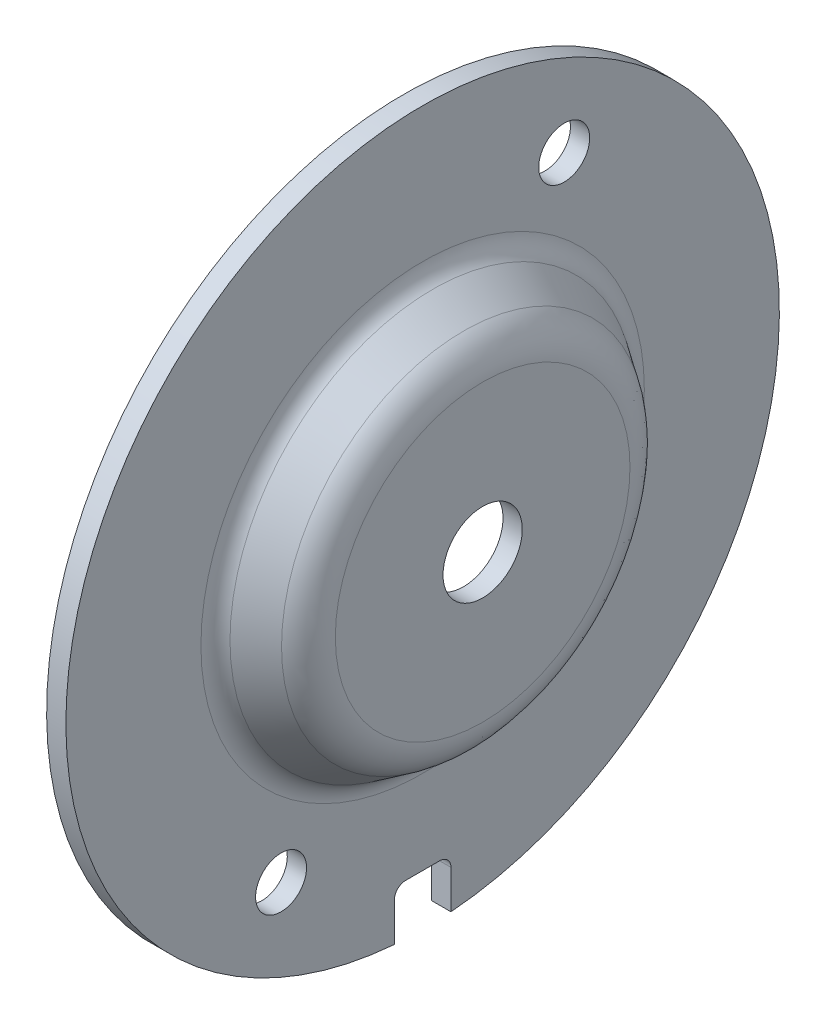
ISO-10303-21;
HEADER;
FILE_DESCRIPTION(('STEP AP214'),'2;1');
FILE_NAME('part.step','',(''),(''),'','','');
FILE_SCHEMA(('AUTOMOTIVE_DESIGN { 1 0 10303 214 1 1 1 1 }'));
ENDSEC;
DATA;
#1=APPLICATION_CONTEXT('core data for automotive mechanical design processes');
#2=APPLICATION_PROTOCOL_DEFINITION('international standard','automotive_design',2000,#1);
#3=PRODUCT_CONTEXT('',#1,'mechanical');
#4=PRODUCT('Part','Part','',(#3));
#5=PRODUCT_RELATED_PRODUCT_CATEGORY('part','',(#4));
#6=PRODUCT_DEFINITION_FORMATION('','',#4);
#7=PRODUCT_DEFINITION_CONTEXT('part definition',#1,'design');
#8=PRODUCT_DEFINITION('design','',#6,#7);
#9=PRODUCT_DEFINITION_SHAPE('','',#8);
#10=(LENGTH_UNIT() NAMED_UNIT(*) SI_UNIT(.MILLI.,.METRE.));
#11=(NAMED_UNIT(*) PLANE_ANGLE_UNIT() SI_UNIT($,.RADIAN.));
#12=(NAMED_UNIT(*) SI_UNIT($,.STERADIAN.) SOLID_ANGLE_UNIT());
#13=UNCERTAINTY_MEASURE_WITH_UNIT(LENGTH_MEASURE(1.E-05),#10,'distance_accuracy_value','');
#14=(GEOMETRIC_REPRESENTATION_CONTEXT(3) GLOBAL_UNCERTAINTY_ASSIGNED_CONTEXT((#13)) GLOBAL_UNIT_ASSIGNED_CONTEXT((#10,
#11,#12)) REPRESENTATION_CONTEXT('',''));
#15=CARTESIAN_POINT('',(0.,0.,0.));
#16=DIRECTION('',(0.,0.,1.));
#17=DIRECTION('',(1.,0.,0.));
#18=AXIS2_PLACEMENT_3D('',#15,#16,#17);
#19=CARTESIAN_POINT('',(53.,19.5759916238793,0.));
#20=DIRECTION('',(1.,0.,0.));
#21=DIRECTION('',(0.,0.,-1.));
#22=AXIS2_PLACEMENT_3D('',#19,#20,#21);
#23=PLANE('',#22);
#24=CARTESIAN_POINT('',(53.,-21.650635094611,12.4999999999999));
#25=DIRECTION('',(1.,0.,0.));
#26=DIRECTION('',(0.,0.,-1.));
#27=AXIS2_PLACEMENT_3D('',#24,#25,#26);
#28=CIRCLE('',#27,2.25);
#29=CARTESIAN_POINT('',(53.,-21.650635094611,10.2499999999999));
#30=VERTEX_POINT('',#29);
#31=EDGE_CURVE('E152',#30,#30,#28,.T.);
#32=ORIENTED_EDGE('',*,*,#31,.T.);
#33=EDGE_LOOP('',(#32));
#34=FACE_BOUND('',#33,.T.);
#35=CARTESIAN_POINT('',(53.,21.650635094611,-12.5));
#36=DIRECTION('',(1.,0.,0.));
#37=DIRECTION('',(0.,0.,-1.));
#38=AXIS2_PLACEMENT_3D('',#35,#36,#37);
#39=CIRCLE('',#38,2.25);
#40=CARTESIAN_POINT('',(53.,21.650635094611,-14.75));
#41=VERTEX_POINT('',#40);
#42=EDGE_CURVE('E156',#41,#41,#39,.T.);
#43=ORIENTED_EDGE('',*,*,#42,.T.);
#44=EDGE_LOOP('',(#43));
#45=FACE_BOUND('',#44,.T.);
#46=CARTESIAN_POINT('',(53.,0.,0.));
#47=DIRECTION('',(-1.,0.,0.));
#48=DIRECTION('',(0.,0.,1.));
#49=AXIS2_PLACEMENT_3D('',#46,#47,#48);
#50=CIRCLE('',#49,19.5759916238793);
#51=CARTESIAN_POINT('',(53.,0.,19.5759916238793));
#52=VERTEX_POINT('',#51);
#53=EDGE_CURVE('E159',#52,#52,#50,.T.);
#54=ORIENTED_EDGE('',*,*,#53,.F.);
#55=EDGE_LOOP('',(#54));
#56=FACE_BOUND('',#55,.T.);
#57=DIRECTION('',(0.,1.,0.));
#58=VECTOR('',#57,1.);
#59=CARTESIAN_POINT('',(53.,-27.,-2.5));
#60=LINE('',#59,#58);
#61=CARTESIAN_POINT('',(53.,-31.4006369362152,-2.5));
#62=VERTEX_POINT('',#61);
#63=CARTESIAN_POINT('',(53.,-28.,-2.5));
#64=VERTEX_POINT('',#63);
#65=EDGE_CURVE('E90',#62,#64,#60,.T.);
#66=ORIENTED_EDGE('',*,*,#65,.T.);
#67=CARTESIAN_POINT('',(53.,-28.,-1.5));
#68=DIRECTION('',(1.,0.,0.));
#69=DIRECTION('',(0.,0.,-1.));
#70=AXIS2_PLACEMENT_3D('',#67,#68,#69);
#71=CIRCLE('',#70,1.);
#72=CARTESIAN_POINT('',(53.,-27.,-1.5));
#73=VERTEX_POINT('',#72);
#74=EDGE_CURVE('E126',#64,#73,#71,.T.);
#75=ORIENTED_EDGE('',*,*,#74,.T.);
#76=DIRECTION('',(0.,0.,1.));
#77=VECTOR('',#76,1.);
#78=CARTESIAN_POINT('',(53.,-27.,2.5));
#79=LINE('',#78,#77);
#80=CARTESIAN_POINT('',(53.,-27.,1.5));
#81=VERTEX_POINT('',#80);
#82=EDGE_CURVE('E163',#73,#81,#79,.T.);
#83=ORIENTED_EDGE('',*,*,#82,.T.);
#84=CARTESIAN_POINT('',(53.,-28.,1.5));
#85=DIRECTION('',(1.,0.,0.));
#86=DIRECTION('',(0.,0.,-1.));
#87=AXIS2_PLACEMENT_3D('',#84,#85,#86);
#88=CIRCLE('',#87,1.);
#89=CARTESIAN_POINT('',(53.,-28.,2.5));
#90=VERTEX_POINT('',#89);
#91=EDGE_CURVE('E11',#81,#90,#88,.T.);
#92=ORIENTED_EDGE('',*,*,#91,.T.);
#93=DIRECTION('',(0.,-1.,0.));
#94=VECTOR('',#93,1.);
#95=CARTESIAN_POINT('',(53.,-31.4006369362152,2.5));
#96=LINE('',#95,#94);
#97=CARTESIAN_POINT('',(53.,-31.4006369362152,2.5));
#98=VERTEX_POINT('',#97);
#99=EDGE_CURVE('E169',#90,#98,#96,.T.);
#100=ORIENTED_EDGE('',*,*,#99,.T.);
#101=CARTESIAN_POINT('',(53.,0.,0.));
#102=DIRECTION('',(-1.,0.,0.));
#103=DIRECTION('',(0.,0.,1.));
#104=AXIS2_PLACEMENT_3D('',#101,#102,#103);
#105=CIRCLE('',#104,31.5);
#106=EDGE_CURVE('E99',#98,#62,#105,.T.);
#107=ORIENTED_EDGE('',*,*,#106,.T.);
#108=EDGE_LOOP('',(#66,#75,#83,#92,#100,#107));
#109=FACE_BOUND('',#108,.T.);
#110=ADVANCED_FACE('F31',(#34,#45,#56,#109),#23,.F.);
#111=CARTESIAN_POINT('',(0.,0.,0.));
#112=DIRECTION('',(-1.,0.,0.));
#113=DIRECTION('',(0.,0.,1.));
#114=AXIS2_PLACEMENT_3D('',#111,#112,#113);
#115=CYLINDRICAL_SURFACE('',#114,31.5);
#116=CARTESIAN_POINT('',(54.7,0.,0.));
#117=DIRECTION('',(-1.,0.,0.));
#118=DIRECTION('',(0.,0.,1.));
#119=AXIS2_PLACEMENT_3D('',#116,#117,#118);
#120=CIRCLE('',#119,31.5);
#121=CARTESIAN_POINT('',(54.7,-31.4006369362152,2.5));
#122=VERTEX_POINT('',#121);
#123=CARTESIAN_POINT('',(54.7,-31.4006369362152,-2.5));
#124=VERTEX_POINT('',#123);
#125=EDGE_CURVE('E97',#122,#124,#120,.T.);
#126=ORIENTED_EDGE('',*,*,#125,.T.);
#127=DIRECTION('',(1.,0.,0.));
#128=VECTOR('',#127,1.);
#129=CARTESIAN_POINT('',(53.,-31.4006369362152,-2.5));
#130=LINE('',#129,#128);
#131=EDGE_CURVE('E101',#62,#124,#130,.T.);
#132=ORIENTED_EDGE('',*,*,#131,.F.);
#133=ORIENTED_EDGE('',*,*,#106,.F.);
#134=DIRECTION('',(1.,0.,0.));
#135=VECTOR('',#134,1.);
#136=CARTESIAN_POINT('',(53.,-31.4006369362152,2.5));
#137=LINE('',#136,#135);
#138=EDGE_CURVE('E85',#98,#122,#137,.T.);
#139=ORIENTED_EDGE('',*,*,#138,.T.);
#140=EDGE_LOOP('',(#126,#132,#133,#139));
#141=FACE_BOUND('',#140,.T.);
#142=ADVANCED_FACE('F95',(#141),#115,.T.);
#143=CARTESIAN_POINT('',(54.7,31.5,0.));
#144=DIRECTION('',(-1.,0.,0.));
#145=DIRECTION('',(0.,0.,1.));
#146=AXIS2_PLACEMENT_3D('',#143,#144,#145);
#147=PLANE('',#146);
#148=CARTESIAN_POINT('',(54.7,-21.650635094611,12.4999999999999));
#149=DIRECTION('',(1.,0.,0.));
#150=DIRECTION('',(0.,0.,-1.));
#151=AXIS2_PLACEMENT_3D('',#148,#149,#150);
#152=CIRCLE('',#151,2.25);
#153=CARTESIAN_POINT('',(54.7,-21.650635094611,10.2499999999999));
#154=VERTEX_POINT('',#153);
#155=EDGE_CURVE('E100',#154,#154,#152,.T.);
#156=ORIENTED_EDGE('',*,*,#155,.F.);
#157=EDGE_LOOP('',(#156));
#158=FACE_BOUND('',#157,.T.);
#159=CARTESIAN_POINT('',(54.7,21.650635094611,-12.5));
#160=DIRECTION('',(1.,0.,0.));
#161=DIRECTION('',(0.,0.,-1.));
#162=AXIS2_PLACEMENT_3D('',#159,#160,#161);
#163=CIRCLE('',#162,2.25);
#164=CARTESIAN_POINT('',(54.7,21.650635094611,-14.75));
#165=VERTEX_POINT('',#164);
#166=EDGE_CURVE('E175',#165,#165,#163,.T.);
#167=ORIENTED_EDGE('',*,*,#166,.F.);
#168=EDGE_LOOP('',(#167));
#169=FACE_BOUND('',#168,.T.);
#170=ORIENTED_EDGE('',*,*,#125,.F.);
#171=DIRECTION('',(0.,-1.,0.));
#172=VECTOR('',#171,1.);
#173=CARTESIAN_POINT('',(54.7,-31.4006369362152,2.5));
#174=LINE('',#173,#172);
#175=CARTESIAN_POINT('',(54.7,-28.,2.5));
#176=VERTEX_POINT('',#175);
#177=EDGE_CURVE('E82',#176,#122,#174,.T.);
#178=ORIENTED_EDGE('',*,*,#177,.F.);
#179=CARTESIAN_POINT('',(54.7,-28.,1.5));
#180=DIRECTION('',(-1.,0.,0.));
#181=DIRECTION('',(0.,0.,1.));
#182=AXIS2_PLACEMENT_3D('',#179,#180,#181);
#183=CIRCLE('',#182,1.);
#184=CARTESIAN_POINT('',(54.7,-27.,1.5));
#185=VERTEX_POINT('',#184);
#186=EDGE_CURVE('E38',#176,#185,#183,.T.);
#187=ORIENTED_EDGE('',*,*,#186,.T.);
#188=DIRECTION('',(0.,0.,1.));
#189=VECTOR('',#188,1.);
#190=CARTESIAN_POINT('',(54.7,-27.,2.5));
#191=LINE('',#190,#189);
#192=CARTESIAN_POINT('',(54.7,-27.,-1.5));
#193=VERTEX_POINT('',#192);
#194=EDGE_CURVE('E91',#193,#185,#191,.T.);
#195=ORIENTED_EDGE('',*,*,#194,.F.);
#196=CARTESIAN_POINT('',(54.7,-28.,-1.5));
#197=DIRECTION('',(-1.,0.,0.));
#198=DIRECTION('',(0.,0.,1.));
#199=AXIS2_PLACEMENT_3D('',#196,#197,#198);
#200=CIRCLE('',#199,1.);
#201=CARTESIAN_POINT('',(54.7,-28.,-2.5));
#202=VERTEX_POINT('',#201);
#203=EDGE_CURVE('E124',#193,#202,#200,.T.);
#204=ORIENTED_EDGE('',*,*,#203,.T.);
#205=DIRECTION('',(0.,1.,0.));
#206=VECTOR('',#205,1.);
#207=CARTESIAN_POINT('',(54.7,-27.,-2.5));
#208=LINE('',#207,#206);
#209=EDGE_CURVE('E107',#124,#202,#208,.T.);
#210=ORIENTED_EDGE('',*,*,#209,.F.);
#211=EDGE_LOOP('',(#170,#178,#187,#195,#204,#210));
#212=FACE_BOUND('',#211,.T.);
#213=CARTESIAN_POINT('',(54.7,0.,0.));
#214=DIRECTION('',(-1.,0.,0.));
#215=DIRECTION('',(0.,0.,1.));
#216=AXIS2_PLACEMENT_3D('',#213,#214,#215);
#217=CIRCLE('',#216,19.5759916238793);
#218=CARTESIAN_POINT('',(54.7,0.,19.5759916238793));
#219=VERTEX_POINT('',#218);
#220=EDGE_CURVE('E108',#219,#219,#217,.T.);
#221=ORIENTED_EDGE('',*,*,#220,.T.);
#222=EDGE_LOOP('',(#221));
#223=FACE_BOUND('',#222,.T.);
#224=ADVANCED_FACE('F104',(#158,#169,#212,#223),#147,.F.);
#225=CARTESIAN_POINT('',(56.7,0.,0.));
#226=DIRECTION('',(-1.,0.,0.));
#227=DIRECTION('',(0.,0.,1.));
#228=AXIS2_PLACEMENT_3D('',#225,#226,#227);
#229=TOROIDAL_SURFACE('',#228,19.5759916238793,2.);
#230=ORIENTED_EDGE('',*,*,#220,.F.);
#231=EDGE_LOOP('',(#230));
#232=FACE_BOUND('',#231,.T.);
#233=CARTESIAN_POINT('',(55.5978769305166,0.,0.));
#234=DIRECTION('',(-1.,0.,0.));
#235=DIRECTION('',(0.,0.,1.));
#236=AXIS2_PLACEMENT_3D('',#233,#234,#235);
#237=CIRCLE('',#236,17.9070624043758);
#238=CARTESIAN_POINT('',(55.5978769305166,0.,17.9070624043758));
#239=VERTEX_POINT('',#238);
#240=EDGE_CURVE('E113',#239,#239,#237,.T.);
#241=ORIENTED_EDGE('',*,*,#240,.T.);
#242=EDGE_LOOP('',(#241));
#243=FACE_BOUND('',#242,.T.);
#244=ADVANCED_FACE('F203',(#232,#243),#229,.F.);
#245=CARTESIAN_POINT('',(58.3389276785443,0.,0.));
#246=DIRECTION('',(-1.,0.,0.));
#247=DIRECTION('',(0.,0.,1.));
#248=AXIS2_PLACEMENT_3D('',#245,#246,#247);
#249=CONICAL_SURFACE('',#248,16.0969345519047,0.583635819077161);
#250=ORIENTED_EDGE('',*,*,#240,.F.);
#251=EDGE_LOOP('',(#250));
#252=FACE_BOUND('',#251,.T.);
#253=CARTESIAN_POINT('',(58.3389276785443,0.,0.));
#254=DIRECTION('',(-1.,0.,0.));
#255=DIRECTION('',(0.,0.,1.));
#256=AXIS2_PLACEMENT_3D('',#253,#254,#255);
#257=CIRCLE('',#256,16.0969345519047);
#258=CARTESIAN_POINT('',(58.3389276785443,0.,16.0969345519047));
#259=VERTEX_POINT('',#258);
#260=EDGE_CURVE('E198',#259,#259,#257,.T.);
#261=ORIENTED_EDGE('',*,*,#260,.T.);
#262=EDGE_LOOP('',(#261));
#263=FACE_BOUND('',#262,.T.);
#264=ADVANCED_FACE('F205',(#252,#263),#249,.T.);
#265=CARTESIAN_POINT('',(56.3,0.,0.));
#266=DIRECTION('',(-1.,0.,0.));
#267=DIRECTION('',(0.,0.,1.));
#268=AXIS2_PLACEMENT_3D('',#265,#266,#267);
#269=TOROIDAL_SURFACE('',#268,13.0094154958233,3.7);
#270=ORIENTED_EDGE('',*,*,#260,.F.);
#271=EDGE_LOOP('',(#270));
#272=FACE_BOUND('',#271,.T.);
#273=CARTESIAN_POINT('',(60.,0.,0.));
#274=DIRECTION('',(-1.,0.,0.));
#275=DIRECTION('',(0.,0.,1.));
#276=AXIS2_PLACEMENT_3D('',#273,#274,#275);
#277=CIRCLE('',#276,13.0094154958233);
#278=CARTESIAN_POINT('',(60.,0.,13.0094154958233));
#279=VERTEX_POINT('',#278);
#280=EDGE_CURVE('E195',#279,#279,#277,.T.);
#281=ORIENTED_EDGE('',*,*,#280,.T.);
#282=EDGE_LOOP('',(#281));
#283=FACE_BOUND('',#282,.T.);
#284=ADVANCED_FACE('F208',(#272,#283),#269,.T.);
#285=CARTESIAN_POINT('',(60.,13.0094154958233,0.));
#286=DIRECTION('',(-1.,0.,0.));
#287=DIRECTION('',(0.,0.,1.));
#288=AXIS2_PLACEMENT_3D('',#285,#286,#287);
#289=PLANE('',#288);
#290=ORIENTED_EDGE('',*,*,#280,.F.);
#291=EDGE_LOOP('',(#290));
#292=FACE_BOUND('',#291,.T.);
#293=CARTESIAN_POINT('',(60.,0.,0.));
#294=DIRECTION('',(-1.,0.,0.));
#295=DIRECTION('',(0.,0.,1.));
#296=AXIS2_PLACEMENT_3D('',#293,#294,#295);
#297=CIRCLE('',#296,3.5);
#298=CARTESIAN_POINT('',(60.,0.,3.5));
#299=VERTEX_POINT('',#298);
#300=EDGE_CURVE('E192',#299,#299,#297,.T.);
#301=ORIENTED_EDGE('',*,*,#300,.T.);
#302=EDGE_LOOP('',(#301));
#303=FACE_BOUND('',#302,.T.);
#304=ADVANCED_FACE('F214',(#292,#303),#289,.F.);
#305=CARTESIAN_POINT('',(0.,0.,0.));
#306=DIRECTION('',(-1.,0.,0.));
#307=DIRECTION('',(0.,0.,1.));
#308=AXIS2_PLACEMENT_3D('',#305,#306,#307);
#309=CYLINDRICAL_SURFACE('',#308,3.5);
#310=ORIENTED_EDGE('',*,*,#300,.F.);
#311=EDGE_LOOP('',(#310));
#312=FACE_BOUND('',#311,.T.);
#313=CARTESIAN_POINT('',(58.3,0.,0.));
#314=DIRECTION('',(-1.,0.,0.));
#315=DIRECTION('',(0.,0.,1.));
#316=AXIS2_PLACEMENT_3D('',#313,#314,#315);
#317=CIRCLE('',#316,3.5);
#318=CARTESIAN_POINT('',(58.3,0.,3.5));
#319=VERTEX_POINT('',#318);
#320=EDGE_CURVE('E189',#319,#319,#317,.T.);
#321=ORIENTED_EDGE('',*,*,#320,.T.);
#322=EDGE_LOOP('',(#321));
#323=FACE_BOUND('',#322,.T.);
#324=ADVANCED_FACE('F220',(#312,#323),#309,.F.);
#325=CARTESIAN_POINT('',(58.3,3.5,0.));
#326=DIRECTION('',(1.,0.,0.));
#327=DIRECTION('',(0.,0.,-1.));
#328=AXIS2_PLACEMENT_3D('',#325,#326,#327);
#329=PLANE('',#328);
#330=ORIENTED_EDGE('',*,*,#320,.F.);
#331=EDGE_LOOP('',(#330));
#332=FACE_BOUND('',#331,.T.);
#333=CARTESIAN_POINT('',(58.3,0.,0.));
#334=DIRECTION('',(-1.,0.,0.));
#335=DIRECTION('',(0.,0.,1.));
#336=AXIS2_PLACEMENT_3D('',#333,#334,#335);
#337=CIRCLE('',#336,13.0094154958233);
#338=CARTESIAN_POINT('',(58.3,0.,13.0094154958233));
#339=VERTEX_POINT('',#338);
#340=EDGE_CURVE('E186',#339,#339,#337,.T.);
#341=ORIENTED_EDGE('',*,*,#340,.T.);
#342=EDGE_LOOP('',(#341));
#343=FACE_BOUND('',#342,.T.);
#344=ADVANCED_FACE('F226',(#332,#343),#329,.F.);
#345=CARTESIAN_POINT('',(56.3,0.,0.));
#346=DIRECTION('',(-1.,0.,0.));
#347=DIRECTION('',(0.,0.,1.));
#348=AXIS2_PLACEMENT_3D('',#345,#346,#347);
#349=TOROIDAL_SURFACE('',#348,13.0094154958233,2.);
#350=ORIENTED_EDGE('',*,*,#340,.F.);
#351=EDGE_LOOP('',(#350));
#352=FACE_BOUND('',#351,.T.);
#353=CARTESIAN_POINT('',(57.4021230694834,0.,0.));
#354=DIRECTION('',(-1.,0.,0.));
#355=DIRECTION('',(0.,0.,1.));
#356=AXIS2_PLACEMENT_3D('',#353,#354,#355);
#357=CIRCLE('',#356,14.6783447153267);
#358=CARTESIAN_POINT('',(57.4021230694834,0.,14.6783447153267));
#359=VERTEX_POINT('',#358);
#360=EDGE_CURVE('E183',#359,#359,#357,.T.);
#361=ORIENTED_EDGE('',*,*,#360,.T.);
#362=EDGE_LOOP('',(#361));
#363=FACE_BOUND('',#362,.T.);
#364=ADVANCED_FACE('F232',(#352,#363),#349,.F.);
#365=CARTESIAN_POINT('',(54.6610723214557,0.,0.));
#366=DIRECTION('',(-1.,0.,0.));
#367=DIRECTION('',(0.,0.,1.));
#368=AXIS2_PLACEMENT_3D('',#365,#366,#367);
#369=CONICAL_SURFACE('',#368,16.4884725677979,0.583635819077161);
#370=ORIENTED_EDGE('',*,*,#360,.F.);
#371=EDGE_LOOP('',(#370));
#372=FACE_BOUND('',#371,.T.);
#373=CARTESIAN_POINT('',(54.6610723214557,0.,0.));
#374=DIRECTION('',(-1.,0.,0.));
#375=DIRECTION('',(0.,0.,1.));
#376=AXIS2_PLACEMENT_3D('',#373,#374,#375);
#377=CIRCLE('',#376,16.4884725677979);
#378=CARTESIAN_POINT('',(54.6610723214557,0.,16.4884725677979));
#379=VERTEX_POINT('',#378);
#380=EDGE_CURVE('E180',#379,#379,#377,.T.);
#381=ORIENTED_EDGE('',*,*,#380,.T.);
#382=EDGE_LOOP('',(#381));
#383=FACE_BOUND('',#382,.T.);
#384=ADVANCED_FACE('F238',(#372,#383),#369,.F.);
#385=CARTESIAN_POINT('',(56.7,0.,0.));
#386=DIRECTION('',(-1.,0.,0.));
#387=DIRECTION('',(0.,0.,1.));
#388=AXIS2_PLACEMENT_3D('',#385,#386,#387);
#389=TOROIDAL_SURFACE('',#388,19.5759916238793,3.7);
#390=ORIENTED_EDGE('',*,*,#380,.F.);
#391=EDGE_LOOP('',(#390));
#392=FACE_BOUND('',#391,.T.);
#393=ORIENTED_EDGE('',*,*,#53,.T.);
#394=EDGE_LOOP('',(#393));
#395=FACE_BOUND('',#394,.T.);
#396=ADVANCED_FACE('F244',(#392,#395),#389,.T.);
#397=CARTESIAN_POINT('',(53.,21.650635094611,-12.5));
#398=DIRECTION('',(1.,0.,0.));
#399=DIRECTION('',(0.,0.,-1.));
#400=AXIS2_PLACEMENT_3D('',#397,#398,#399);
#401=CYLINDRICAL_SURFACE('',#400,2.25);
#402=CARTESIAN_POINT('',(53.,21.650635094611,-14.75));
#403=CARTESIAN_POINT('',(53.0177083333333,21.650635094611,-14.75));
#404=CARTESIAN_POINT('',(53.0354166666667,21.650635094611,-14.75));
#405=CARTESIAN_POINT('',(53.0708333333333,21.650635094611,-14.75));
#406=CARTESIAN_POINT('',(53.0885416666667,21.650635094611,-14.75));
#407=CARTESIAN_POINT('',(53.1239583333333,21.650635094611,-14.75));
#408=CARTESIAN_POINT('',(53.1416666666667,21.650635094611,-14.75));
#409=CARTESIAN_POINT('',(53.1770833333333,21.650635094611,-14.75));
#410=CARTESIAN_POINT('',(53.1947916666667,21.650635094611,-14.75));
#411=CARTESIAN_POINT('',(53.2302083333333,21.650635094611,-14.75));
#412=CARTESIAN_POINT('',(53.2479166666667,21.650635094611,-14.75));
#413=CARTESIAN_POINT('',(53.2833333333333,21.650635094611,-14.75));
#414=CARTESIAN_POINT('',(53.3010416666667,21.650635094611,-14.75));
#415=CARTESIAN_POINT('',(53.3364583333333,21.650635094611,-14.75));
#416=CARTESIAN_POINT('',(53.3541666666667,21.650635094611,-14.75));
#417=CARTESIAN_POINT('',(53.3895833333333,21.650635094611,-14.75));
#418=CARTESIAN_POINT('',(53.4072916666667,21.650635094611,-14.75));
#419=CARTESIAN_POINT('',(53.4427083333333,21.650635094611,-14.75));
#420=CARTESIAN_POINT('',(53.4604166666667,21.650635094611,-14.75));
#421=CARTESIAN_POINT('',(53.4958333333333,21.650635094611,-14.75));
#422=CARTESIAN_POINT('',(53.5135416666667,21.650635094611,-14.75));
#423=CARTESIAN_POINT('',(53.5489583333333,21.650635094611,-14.75));
#424=CARTESIAN_POINT('',(53.5666666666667,21.650635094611,-14.75));
#425=CARTESIAN_POINT('',(53.6020833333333,21.650635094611,-14.75));
#426=CARTESIAN_POINT('',(53.6197916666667,21.650635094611,-14.75));
#427=CARTESIAN_POINT('',(53.6552083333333,21.650635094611,-14.75));
#428=CARTESIAN_POINT('',(53.6729166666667,21.650635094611,-14.75));
#429=CARTESIAN_POINT('',(53.7083333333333,21.650635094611,-14.75));
#430=CARTESIAN_POINT('',(53.7260416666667,21.650635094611,-14.75));
#431=CARTESIAN_POINT('',(53.7614583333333,21.650635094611,-14.75));
#432=CARTESIAN_POINT('',(53.7791666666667,21.650635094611,-14.75));
#433=CARTESIAN_POINT('',(53.8145833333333,21.650635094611,-14.75));
#434=CARTESIAN_POINT('',(53.8322916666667,21.650635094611,-14.75));
#435=CARTESIAN_POINT('',(53.8677083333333,21.650635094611,-14.75));
#436=CARTESIAN_POINT('',(53.8854166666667,21.650635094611,-14.75));
#437=CARTESIAN_POINT('',(53.9208333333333,21.650635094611,-14.75));
#438=CARTESIAN_POINT('',(53.9385416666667,21.650635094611,-14.75));
#439=CARTESIAN_POINT('',(53.9739583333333,21.650635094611,-14.75));
#440=CARTESIAN_POINT('',(53.9916666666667,21.650635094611,-14.75));
#441=CARTESIAN_POINT('',(54.0270833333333,21.650635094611,-14.75));
#442=CARTESIAN_POINT('',(54.0447916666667,21.650635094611,-14.75));
#443=CARTESIAN_POINT('',(54.0802083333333,21.650635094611,-14.75));
#444=CARTESIAN_POINT('',(54.0979166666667,21.650635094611,-14.75));
#445=CARTESIAN_POINT('',(54.1333333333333,21.650635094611,-14.75));
#446=CARTESIAN_POINT('',(54.1510416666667,21.650635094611,-14.75));
#447=CARTESIAN_POINT('',(54.1864583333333,21.650635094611,-14.75));
#448=CARTESIAN_POINT('',(54.2041666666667,21.650635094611,-14.75));
#449=CARTESIAN_POINT('',(54.2395833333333,21.650635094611,-14.75));
#450=CARTESIAN_POINT('',(54.2572916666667,21.650635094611,-14.75));
#451=CARTESIAN_POINT('',(54.2927083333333,21.650635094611,-14.75));
#452=CARTESIAN_POINT('',(54.3104166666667,21.650635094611,-14.75));
#453=CARTESIAN_POINT('',(54.3458333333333,21.650635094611,-14.75));
#454=CARTESIAN_POINT('',(54.3635416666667,21.650635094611,-14.75));
#455=CARTESIAN_POINT('',(54.3989583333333,21.650635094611,-14.75));
#456=CARTESIAN_POINT('',(54.4166666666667,21.650635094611,-14.75));
#457=CARTESIAN_POINT('',(54.4520833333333,21.650635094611,-14.75));
#458=CARTESIAN_POINT('',(54.4697916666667,21.650635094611,-14.75));
#459=CARTESIAN_POINT('',(54.5052083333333,21.650635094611,-14.75));
#460=CARTESIAN_POINT('',(54.5229166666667,21.650635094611,-14.75));
#461=CARTESIAN_POINT('',(54.5583333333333,21.650635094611,-14.75));
#462=CARTESIAN_POINT('',(54.5760416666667,21.650635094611,-14.75));
#463=CARTESIAN_POINT('',(54.6114583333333,21.650635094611,-14.75));
#464=CARTESIAN_POINT('',(54.6291666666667,21.650635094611,-14.75));
#465=CARTESIAN_POINT('',(54.6645833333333,21.650635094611,-14.75));
#466=CARTESIAN_POINT('',(54.6822916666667,21.650635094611,-14.75));
#467=CARTESIAN_POINT('',(54.7,21.650635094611,-14.75));
#468=B_SPLINE_CURVE_WITH_KNOTS('',3,(#402,#403,#404,#405,#406,#407,#408,#409,#410,#411,#412,
#413,#414,#415,#416,#417,#418,#419,#420,#421,#422,#423,#424,#425,#426,#427,#428,#429,#430,#431,
#432,#433,#434,#435,#436,#437,#438,#439,#440,#441,#442,#443,#444,#445,#446,#447,#448,#449,#450,
#451,#452,#453,#454,#455,#456,#457,#458,#459,#460,#461,#462,#463,#464,#465,#466,#467),
.UNSPECIFIED.,.F.,.F.,(4,2,2,2,2,2,2,2,2,2,2,2,2,2,2,2,2,2,2,2,2,2,2,2,2,2,2,2,2,2,2,2,4),(0.,
0.0531250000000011,0.106250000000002,0.159375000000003,0.212500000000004,0.265625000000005,
0.318750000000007,0.371875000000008,0.425000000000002,0.478125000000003,0.531250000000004,
0.584375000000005,0.637500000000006,0.690625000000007,0.743750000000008,0.796875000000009,
0.850000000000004,0.903125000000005,0.956250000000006,1.00937500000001,1.06250000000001,
1.11562500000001,1.16875000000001,1.22187500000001,1.27500000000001,1.32812500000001,
1.38125000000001,1.43437500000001,1.48750000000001,1.54062500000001,1.59375000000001,
1.64687500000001,1.70000000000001),.UNSPECIFIED.);
#469=EDGE_CURVE('BSEAM250',#41,#165,#468,.T.);
#470=ORIENTED_EDGE('',*,*,#42,.F.);
#471=ORIENTED_EDGE('',*,*,#166,.T.);
#472=ORIENTED_EDGE('',*,*,#469,.T.);
#473=ORIENTED_EDGE('',*,*,#469,.F.);
#474=EDGE_LOOP('',(#470,#472,#471,#473));
#475=FACE_BOUND('',#474,.T.);
#476=ADVANCED_FACE('F250',(#475),#401,.F.);
#477=CARTESIAN_POINT('',(53.,-21.650635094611,12.4999999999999));
#478=DIRECTION('',(1.,0.,0.));
#479=DIRECTION('',(0.,0.,-1.));
#480=AXIS2_PLACEMENT_3D('',#477,#478,#479);
#481=CYLINDRICAL_SURFACE('',#480,2.25);
#482=CARTESIAN_POINT('',(53.,-21.650635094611,10.2499999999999));
#483=CARTESIAN_POINT('',(53.0177083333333,-21.650635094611,10.2499999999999));
#484=CARTESIAN_POINT('',(53.0354166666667,-21.650635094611,10.2499999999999));
#485=CARTESIAN_POINT('',(53.0708333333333,-21.650635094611,10.2499999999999));
#486=CARTESIAN_POINT('',(53.0885416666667,-21.650635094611,10.2499999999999));
#487=CARTESIAN_POINT('',(53.1239583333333,-21.650635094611,10.2499999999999));
#488=CARTESIAN_POINT('',(53.1416666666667,-21.650635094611,10.2499999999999));
#489=CARTESIAN_POINT('',(53.1770833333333,-21.650635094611,10.2499999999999));
#490=CARTESIAN_POINT('',(53.1947916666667,-21.650635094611,10.2499999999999));
#491=CARTESIAN_POINT('',(53.2302083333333,-21.650635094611,10.2499999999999));
#492=CARTESIAN_POINT('',(53.2479166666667,-21.650635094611,10.2499999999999));
#493=CARTESIAN_POINT('',(53.2833333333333,-21.650635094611,10.2499999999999));
#494=CARTESIAN_POINT('',(53.3010416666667,-21.650635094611,10.2499999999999));
#495=CARTESIAN_POINT('',(53.3364583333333,-21.650635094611,10.2499999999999));
#496=CARTESIAN_POINT('',(53.3541666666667,-21.650635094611,10.2499999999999));
#497=CARTESIAN_POINT('',(53.3895833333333,-21.650635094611,10.2499999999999));
#498=CARTESIAN_POINT('',(53.4072916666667,-21.650635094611,10.2499999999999));
#499=CARTESIAN_POINT('',(53.4427083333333,-21.650635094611,10.2499999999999));
#500=CARTESIAN_POINT('',(53.4604166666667,-21.650635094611,10.2499999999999));
#501=CARTESIAN_POINT('',(53.4958333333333,-21.650635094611,10.2499999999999));
#502=CARTESIAN_POINT('',(53.5135416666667,-21.650635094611,10.2499999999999));
#503=CARTESIAN_POINT('',(53.5489583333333,-21.650635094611,10.2499999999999));
#504=CARTESIAN_POINT('',(53.5666666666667,-21.650635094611,10.2499999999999));
#505=CARTESIAN_POINT('',(53.6020833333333,-21.650635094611,10.2499999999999));
#506=CARTESIAN_POINT('',(53.6197916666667,-21.650635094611,10.2499999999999));
#507=CARTESIAN_POINT('',(53.6552083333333,-21.650635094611,10.2499999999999));
#508=CARTESIAN_POINT('',(53.6729166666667,-21.650635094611,10.2499999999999));
#509=CARTESIAN_POINT('',(53.7083333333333,-21.650635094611,10.2499999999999));
#510=CARTESIAN_POINT('',(53.7260416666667,-21.650635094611,10.2499999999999));
#511=CARTESIAN_POINT('',(53.7614583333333,-21.650635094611,10.2499999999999));
#512=CARTESIAN_POINT('',(53.7791666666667,-21.650635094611,10.2499999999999));
#513=CARTESIAN_POINT('',(53.8145833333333,-21.650635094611,10.2499999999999));
#514=CARTESIAN_POINT('',(53.8322916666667,-21.650635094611,10.2499999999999));
#515=CARTESIAN_POINT('',(53.8677083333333,-21.650635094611,10.2499999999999));
#516=CARTESIAN_POINT('',(53.8854166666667,-21.650635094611,10.2499999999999));
#517=CARTESIAN_POINT('',(53.9208333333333,-21.650635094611,10.2499999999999));
#518=CARTESIAN_POINT('',(53.9385416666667,-21.650635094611,10.2499999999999));
#519=CARTESIAN_POINT('',(53.9739583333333,-21.650635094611,10.2499999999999));
#520=CARTESIAN_POINT('',(53.9916666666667,-21.650635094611,10.2499999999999));
#521=CARTESIAN_POINT('',(54.0270833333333,-21.650635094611,10.2499999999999));
#522=CARTESIAN_POINT('',(54.0447916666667,-21.650635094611,10.2499999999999));
#523=CARTESIAN_POINT('',(54.0802083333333,-21.650635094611,10.2499999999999));
#524=CARTESIAN_POINT('',(54.0979166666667,-21.650635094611,10.2499999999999));
#525=CARTESIAN_POINT('',(54.1333333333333,-21.650635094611,10.2499999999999));
#526=CARTESIAN_POINT('',(54.1510416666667,-21.650635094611,10.2499999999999));
#527=CARTESIAN_POINT('',(54.1864583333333,-21.650635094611,10.2499999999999));
#528=CARTESIAN_POINT('',(54.2041666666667,-21.650635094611,10.2499999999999));
#529=CARTESIAN_POINT('',(54.2395833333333,-21.650635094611,10.2499999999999));
#530=CARTESIAN_POINT('',(54.2572916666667,-21.650635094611,10.2499999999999));
#531=CARTESIAN_POINT('',(54.2927083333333,-21.650635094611,10.2499999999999));
#532=CARTESIAN_POINT('',(54.3104166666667,-21.650635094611,10.2499999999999));
#533=CARTESIAN_POINT('',(54.3458333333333,-21.650635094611,10.2499999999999));
#534=CARTESIAN_POINT('',(54.3635416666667,-21.650635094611,10.2499999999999));
#535=CARTESIAN_POINT('',(54.3989583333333,-21.650635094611,10.2499999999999));
#536=CARTESIAN_POINT('',(54.4166666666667,-21.650635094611,10.2499999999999));
#537=CARTESIAN_POINT('',(54.4520833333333,-21.650635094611,10.2499999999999));
#538=CARTESIAN_POINT('',(54.4697916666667,-21.650635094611,10.2499999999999));
#539=CARTESIAN_POINT('',(54.5052083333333,-21.650635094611,10.2499999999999));
#540=CARTESIAN_POINT('',(54.5229166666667,-21.650635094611,10.2499999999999));
#541=CARTESIAN_POINT('',(54.5583333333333,-21.650635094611,10.2499999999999));
#542=CARTESIAN_POINT('',(54.5760416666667,-21.650635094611,10.2499999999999));
#543=CARTESIAN_POINT('',(54.6114583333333,-21.650635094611,10.2499999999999));
#544=CARTESIAN_POINT('',(54.6291666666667,-21.650635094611,10.2499999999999));
#545=CARTESIAN_POINT('',(54.6645833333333,-21.650635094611,10.2499999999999));
#546=CARTESIAN_POINT('',(54.6822916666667,-21.650635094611,10.2499999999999));
#547=CARTESIAN_POINT('',(54.7,-21.650635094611,10.2499999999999));
#548=B_SPLINE_CURVE_WITH_KNOTS('',3,(#482,#483,#484,#485,#486,#487,#488,#489,#490,#491,#492,
#493,#494,#495,#496,#497,#498,#499,#500,#501,#502,#503,#504,#505,#506,#507,#508,#509,#510,#511,
#512,#513,#514,#515,#516,#517,#518,#519,#520,#521,#522,#523,#524,#525,#526,#527,#528,#529,#530,
#531,#532,#533,#534,#535,#536,#537,#538,#539,#540,#541,#542,#543,#544,#545,#546,#547),
.UNSPECIFIED.,.F.,.F.,(4,2,2,2,2,2,2,2,2,2,2,2,2,2,2,2,2,2,2,2,2,2,2,2,2,2,2,2,2,2,2,2,4),(0.,
0.0531250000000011,0.106250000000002,0.159375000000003,0.212500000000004,0.265625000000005,
0.318750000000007,0.371875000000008,0.425000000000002,0.478125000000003,0.531250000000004,
0.584375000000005,0.637500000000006,0.690625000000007,0.743750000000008,0.796875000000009,
0.850000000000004,0.903125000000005,0.956250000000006,1.00937500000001,1.06250000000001,
1.11562500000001,1.16875000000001,1.22187500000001,1.27500000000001,1.32812500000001,
1.38125000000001,1.43437500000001,1.48750000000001,1.54062500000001,1.59375000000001,
1.64687500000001,1.70000000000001),.UNSPECIFIED.);
#549=EDGE_CURVE('BSEAM255',#30,#154,#548,.T.);
#550=ORIENTED_EDGE('',*,*,#31,.F.);
#551=ORIENTED_EDGE('',*,*,#155,.T.);
#552=ORIENTED_EDGE('',*,*,#549,.T.);
#553=ORIENTED_EDGE('',*,*,#549,.F.);
#554=EDGE_LOOP('',(#550,#552,#551,#553));
#555=FACE_BOUND('',#554,.T.);
#556=ADVANCED_FACE('F255',(#555),#481,.F.);
#557=CARTESIAN_POINT('',(53.,-31.4006369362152,2.5));
#558=DIRECTION('',(0.,0.,1.));
#559=DIRECTION('',(1.,0.,0.));
#560=AXIS2_PLACEMENT_3D('',#557,#558,#559);
#561=PLANE('',#560);
#562=ORIENTED_EDGE('',*,*,#99,.F.);
#563=DIRECTION('',(1.,0.,0.));
#564=VECTOR('',#563,1.);
#565=CARTESIAN_POINT('',(54.7,-28.,2.5));
#566=LINE('',#565,#564);
#567=EDGE_CURVE('E87',#90,#176,#566,.T.);
#568=ORIENTED_EDGE('',*,*,#567,.T.);
#569=ORIENTED_EDGE('',*,*,#177,.T.);
#570=ORIENTED_EDGE('',*,*,#138,.F.);
#571=EDGE_LOOP('',(#562,#568,#569,#570));
#572=FACE_BOUND('',#571,.T.);
#573=ADVANCED_FACE('F84',(#572),#561,.F.);
#574=CARTESIAN_POINT('',(53.,-27.,2.5));
#575=DIRECTION('',(0.,1.,0.));
#576=DIRECTION('',(0.,0.,1.));
#577=AXIS2_PLACEMENT_3D('',#574,#575,#576);
#578=PLANE('',#577);
#579=ORIENTED_EDGE('',*,*,#82,.F.);
#580=DIRECTION('',(1.,0.,0.));
#581=VECTOR('',#580,1.);
#582=CARTESIAN_POINT('',(54.7,-27.,-1.5));
#583=LINE('',#582,#581);
#584=EDGE_CURVE('E118',#73,#193,#583,.T.);
#585=ORIENTED_EDGE('',*,*,#584,.T.);
#586=ORIENTED_EDGE('',*,*,#194,.T.);
#587=DIRECTION('',(1.,0.,0.));
#588=VECTOR('',#587,1.);
#589=CARTESIAN_POINT('',(53.,-27.,1.5));
#590=LINE('',#589,#588);
#591=EDGE_CURVE('E110',#185,#81,#590,.F.);
#592=ORIENTED_EDGE('',*,*,#591,.T.);
#593=EDGE_LOOP('',(#579,#585,#586,#592));
#594=FACE_BOUND('',#593,.T.);
#595=ADVANCED_FACE('F131',(#594),#578,.F.);
#596=CARTESIAN_POINT('',(53.,-27.,-2.5));
#597=DIRECTION('',(0.,0.,-1.));
#598=DIRECTION('',(0.,1.,0.));
#599=AXIS2_PLACEMENT_3D('',#596,#597,#598);
#600=PLANE('',#599);
#601=ORIENTED_EDGE('',*,*,#209,.T.);
#602=DIRECTION('',(1.,0.,0.));
#603=VECTOR('',#602,1.);
#604=CARTESIAN_POINT('',(53.,-28.,-2.5));
#605=LINE('',#604,#603);
#606=EDGE_CURVE('E121',#202,#64,#605,.F.);
#607=ORIENTED_EDGE('',*,*,#606,.T.);
#608=ORIENTED_EDGE('',*,*,#65,.F.);
#609=ORIENTED_EDGE('',*,*,#131,.T.);
#610=EDGE_LOOP('',(#601,#607,#608,#609));
#611=FACE_BOUND('',#610,.T.);
#612=ADVANCED_FACE('F141',(#611),#600,.F.);
#613=CARTESIAN_POINT('',(53.,-28.,-1.5));
#614=DIRECTION('',(-1.,0.,0.));
#615=DIRECTION('',(0.,0.,1.));
#616=AXIS2_PLACEMENT_3D('',#613,#614,#615);
#617=CYLINDRICAL_SURFACE('',#616,1.);
#618=ORIENTED_EDGE('',*,*,#74,.F.);
#619=ORIENTED_EDGE('',*,*,#606,.F.);
#620=ORIENTED_EDGE('',*,*,#203,.F.);
#621=ORIENTED_EDGE('',*,*,#584,.F.);
#622=EDGE_LOOP('',(#618,#619,#620,#621));
#623=FACE_BOUND('',#622,.T.);
#624=ADVANCED_FACE('F136',(#623),#617,.F.);
#625=CARTESIAN_POINT('',(53.,-28.,1.5));
#626=DIRECTION('',(-1.,0.,0.));
#627=DIRECTION('',(0.,0.,1.));
#628=AXIS2_PLACEMENT_3D('',#625,#626,#627);
#629=CYLINDRICAL_SURFACE('',#628,1.);
#630=ORIENTED_EDGE('',*,*,#91,.F.);
#631=ORIENTED_EDGE('',*,*,#591,.F.);
#632=ORIENTED_EDGE('',*,*,#186,.F.);
#633=ORIENTED_EDGE('',*,*,#567,.F.);
#634=EDGE_LOOP('',(#630,#631,#632,#633));
#635=FACE_BOUND('',#634,.T.);
#636=ADVANCED_FACE('F134',(#635),#629,.F.);
#637=CLOSED_SHELL('',(#110,#142,#224,#244,#264,#284,#304,#324,#344,#364,#384,#396,#476,#556,
#573,#595,#612,#624,#636));
#638=MANIFOLD_SOLID_BREP('B2',#637);
#639=ADVANCED_BREP_SHAPE_REPRESENTATION('',(#18,#638),#14);
#640=SHAPE_DEFINITION_REPRESENTATION(#9,#639);
ENDSEC;
END-ISO-10303-21;
